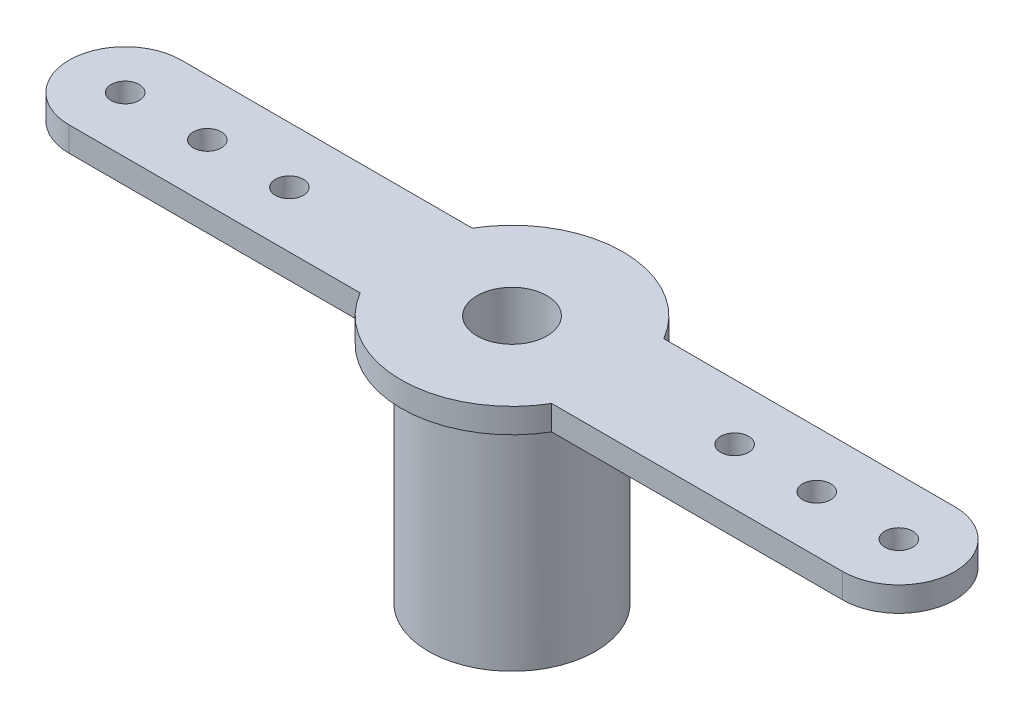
from build123d import *

# Parameters (mm, degrees)
ESQUISSE1_R             = 0.8
BOSS_EXTRU_1_DEPTH      = 1.41
ESQUISSE2_R             = 4.785
BOSS_EXTRU_2_DEPTH      = 12.83
ESQUISSE3_R             = 2
ENL_V_MAT_EXTRU_1_DEPTH = 30.76109205
ESQUISSE4_R             = 1.72
ENL_V_MAT_EXTRU_2_DEPTH = 30.112778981


with BuildPart() as part:
    # Esquisse1 → Boss.-Extru.1 (new body)
    with BuildSketch(Plane(origin=(0, 0, 0), x_dir=(1, 0, 0), z_dir=(0, 1, 0))):
        with BuildLine():
            Line((-22.14, 3.21), (-5.478905, 3.21))
            ThreePointArc((-5.478905, 3.21), (0, 6.35), (5.478905, 3.21))
            Line((5.478905, 3.21), (22.14, 3.21))
            ThreePointArc((22.14, 3.21), (25.35, 0), (22.14, -3.21))
            Line((22.14, -3.21), (5.478905, -3.21))
            ThreePointArc((5.478905, -3.21), (0, -6.35), (-5.478905, -3.21))
            Line((-5.478905, -3.21), (-22.14, -3.21))
            ThreePointArc((-22.14, -3.21), (-25.35, 0), (-22.14, 3.21))
        make_face()
        with Locations(Location((-22.14, 0, 0), (0, 0, 270))):
            Circle(ESQUISSE1_R, mode=Mode.SUBTRACT)
        with Locations(Location((-12.74, 0, 0), (0, 0, 270))):
            Circle(ESQUISSE1_R, mode=Mode.SUBTRACT)
        with Locations(Location((-17.44, 0, 0), (0, 0, 270))):
            Circle(ESQUISSE1_R, mode=Mode.SUBTRACT)
        with Locations(Location((22.14, 0, 0), (0, 0, 270))):
            Circle(ESQUISSE1_R, mode=Mode.SUBTRACT)
        with Locations(Location((12.74, 0, 0), (0, 0, 270))):
            Circle(ESQUISSE1_R, mode=Mode.SUBTRACT)
        with Locations(Location((17.44, 0, 0), (0, 0, 270))):
            Circle(ESQUISSE1_R, mode=Mode.SUBTRACT)
    extrude(amount=BOSS_EXTRU_1_DEPTH)

    # Esquisse2 → Boss.-Extru.2 (add)
    with BuildSketch(Plane.XZ):
        with Locations(Location((0, 0, 0), (0, 0, 90))):
            Circle(ESQUISSE2_R)
    extrude(amount=BOSS_EXTRU_2_DEPTH)

    # Esquisse3 → Enl_v. mat.-Extru.1 (cut, through all)
    with BuildSketch(Plane.XZ.offset(12.83)):
        with Locations(Location((0, 0, 0), (0, 0, 270))):
            Circle(ESQUISSE3_R)
    extrude(amount=-ENL_V_MAT_EXTRU_1_DEPTH, mode=Mode.SUBTRACT)

    # Esquisse4 → Enl_v. mat.-Extru.2 (cut, through all)
    with BuildSketch(Plane.XY):
        with Locations((0, -6.01)):
            Circle(ESQUISSE4_R)
    extrude(amount=-ENL_V_MAT_EXTRU_2_DEPTH, mode=Mode.SUBTRACT)


solid = part.part
